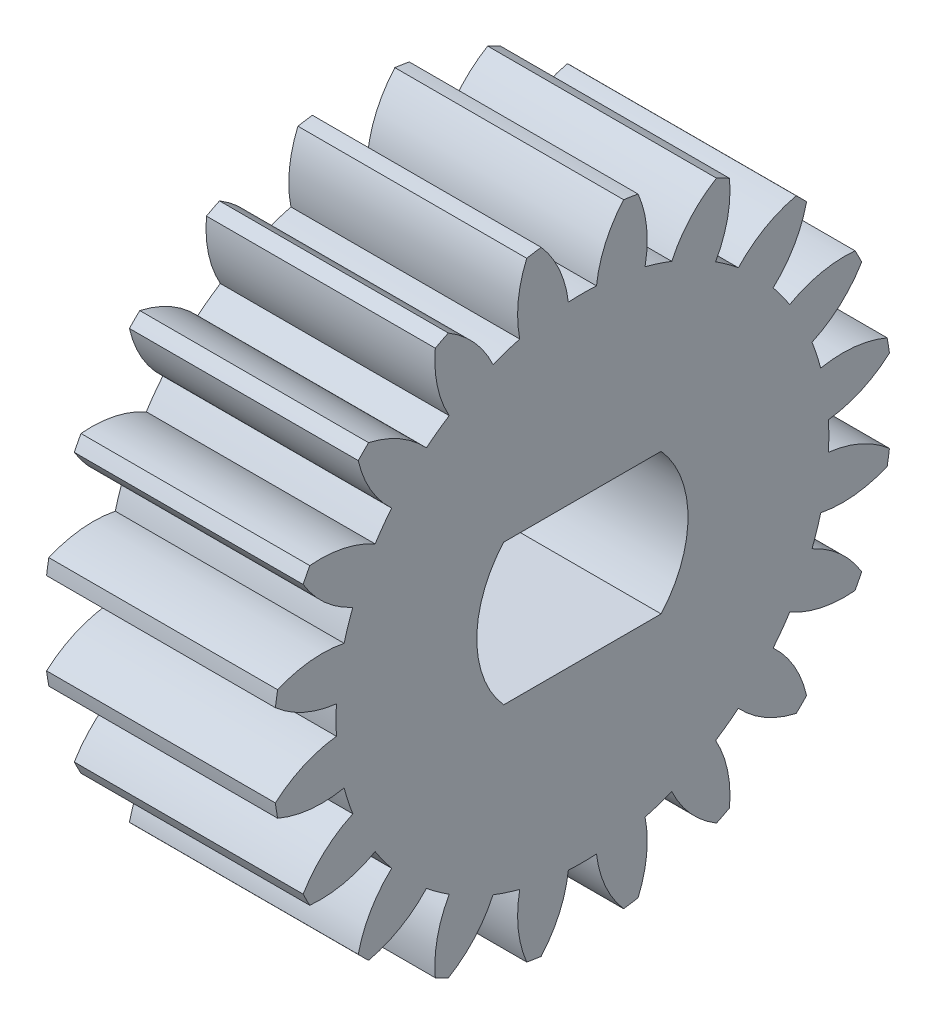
from build123d import *

# Parameters (mm, degrees)
BASPROSKE_W     = 6.5
BASPROSKE_H     = 8.8
TOOTHCUT_DEPTH  = 15.040299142
TEETHCUTS_COUNT = 20
BORE_DEPTH      = 50.0000508


with BuildPart() as part:
    # BasProSke → Base-Revolve (revolve)
    with BuildSketch(Plane(origin=(0, 0, 0), x_dir=(1, 0, 0), z_dir=(0, 1, 0)), mode=Mode.PRIVATE) as base_revolve_sk:
        with Locations((3.25, 4.4)):
            Rectangle(BASPROSKE_W, BASPROSKE_H)
    revolve(base_revolve_sk.sketch.rotate(Axis((-10, 0, 0), (1, 0, 0)), 180), axis=Axis((-10, 0, 0), (1, 0, 0)))

    # TooCutSke → ToothCut (cut, through all)
    with BuildSketch(Plane(origin=(0, 0, 0), x_dir=(0, 0, -1), z_dir=(1, 0, 0))):
        with BuildLine():
            ThreePointArc((0.39930266, 6.987600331), (0, 6.999), (-0.39930266, 6.987600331))
            ThreePointArc((-0.39930266, 6.987600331), (-0.659963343, 7.927158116), (-1.191466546, 8.744603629))
            ThreePointArc((-1.191466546, 8.744603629), (0, 8.8254), (1.191466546, 8.744603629))
            ThreePointArc((1.191466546, 8.744603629), (0.659963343, 7.927158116), (0.39930266, 6.987600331))
        make_face()
    toothcut = extrude(amount=TOOTHCUT_DEPTH, mode=Mode.SUBTRACT)

    # TeethCuts: ToothCut ×20 about axis
    teethcuts_axis = Axis((0, 0, 0), (1, 0, 0))
    for i in range(1, TEETHCUTS_COUNT):
        add(toothcut.rotate(teethcuts_axis, i * 360 / TEETHCUTS_COUNT), mode=Mode.SUBTRACT)

    # BorSke → Bore (cut, symmetric)
    with BuildSketch(Plane(origin=(0, 0, 0), x_dir=(0, 0, -1), z_dir=(1, 0, 0))):
        with BuildLine():
            Line((-2.236067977, 2), (2.236067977, 2))
            ThreePointArc((2.236067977, 2), (3, 0), (2.236067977, -2))
            Line((2.236067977, -2), (-2.236067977, -2))
            ThreePointArc((-2.236067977, -2), (-3, 0), (-2.236067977, 2))
        make_face()
    extrude(amount=BORE_DEPTH, both=True, mode=Mode.SUBTRACT)


solid = part.part
